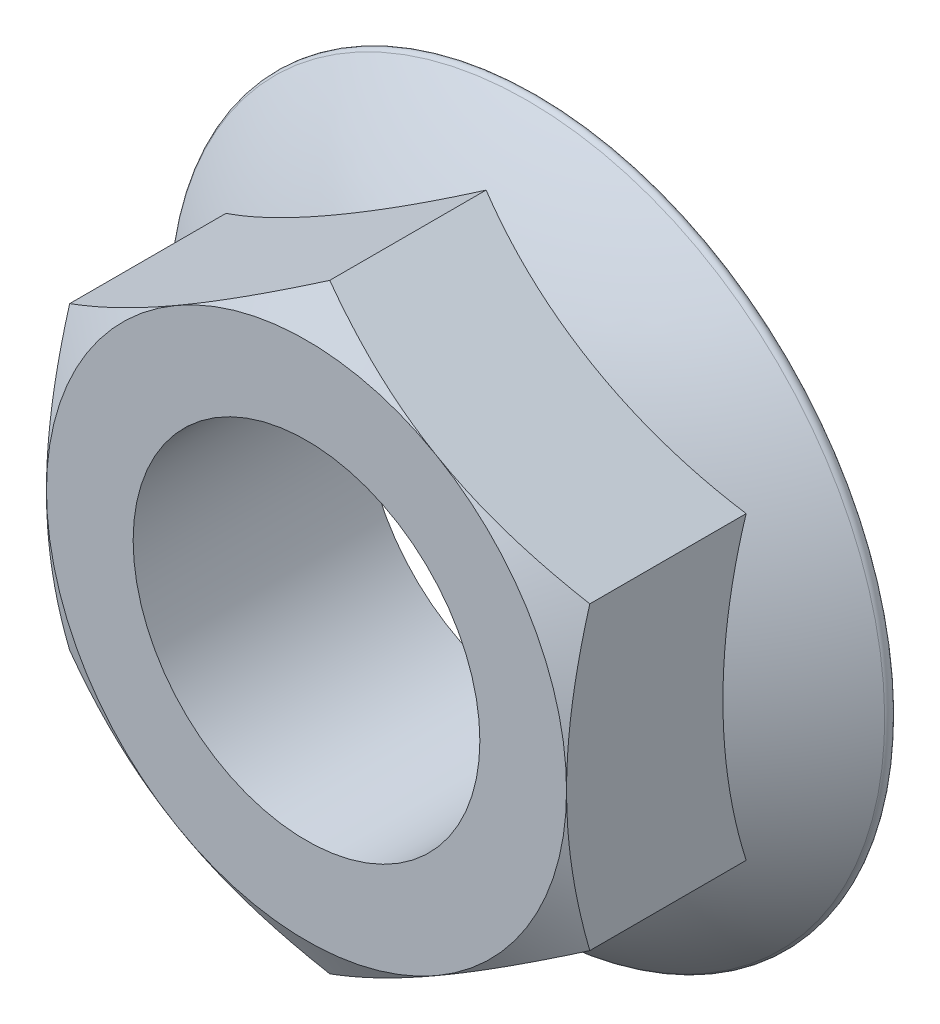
ISO-10303-21;
HEADER;
FILE_DESCRIPTION(('STEP AP214'),'2;1');
FILE_NAME('part.step','',(''),(''),'','','');
FILE_SCHEMA(('AUTOMOTIVE_DESIGN { 1 0 10303 214 1 1 1 1 }'));
ENDSEC;
DATA;
#1=APPLICATION_CONTEXT('core data for automotive mechanical design processes');
#2=APPLICATION_PROTOCOL_DEFINITION('international standard','automotive_design',2000,#1);
#3=PRODUCT_CONTEXT('',#1,'mechanical');
#4=PRODUCT('Part','Part','',(#3));
#5=PRODUCT_RELATED_PRODUCT_CATEGORY('part','',(#4));
#6=PRODUCT_DEFINITION_FORMATION('','',#4);
#7=PRODUCT_DEFINITION_CONTEXT('part definition',#1,'design');
#8=PRODUCT_DEFINITION('design','',#6,#7);
#9=PRODUCT_DEFINITION_SHAPE('','',#8);
#10=(LENGTH_UNIT() NAMED_UNIT(*) SI_UNIT(.MILLI.,.METRE.));
#11=(NAMED_UNIT(*) PLANE_ANGLE_UNIT() SI_UNIT($,.RADIAN.));
#12=(NAMED_UNIT(*) SI_UNIT($,.STERADIAN.) SOLID_ANGLE_UNIT());
#13=UNCERTAINTY_MEASURE_WITH_UNIT(LENGTH_MEASURE(1.E-05),#10,'distance_accuracy_value','');
#14=(GEOMETRIC_REPRESENTATION_CONTEXT(3) GLOBAL_UNCERTAINTY_ASSIGNED_CONTEXT((#13)) GLOBAL_UNIT_ASSIGNED_CONTEXT((#10,
#11,#12)) REPRESENTATION_CONTEXT('',''));
#15=CARTESIAN_POINT('',(0.,0.,0.));
#16=DIRECTION('',(0.,0.,1.));
#17=DIRECTION('',(1.,0.,0.));
#18=AXIS2_PLACEMENT_3D('',#15,#16,#17);
#19=CARTESIAN_POINT('',(22.4999999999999,12.9903810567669,20.));
#20=DIRECTION('',(-0.499999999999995,-0.866025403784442,0.));
#21=DIRECTION('',(0.866025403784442,-0.499999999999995,0.));
#22=AXIS2_PLACEMENT_3D('',#19,#20,#21);
#23=PLANE('',#22);
#24=CARTESIAN_POINT('',(22.5001999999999,12.990265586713,17.9903143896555));
#25=CARTESIAN_POINT('',(22.0056596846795,13.2757885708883,18.1551492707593));
#26=CARTESIAN_POINT('',(21.5091903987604,13.5624252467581,18.3125041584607));
#27=CARTESIAN_POINT('',(20.512270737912,14.1379970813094,18.6101747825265));
#28=CARTESIAN_POINT('',(20.0118191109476,14.4269329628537,18.7504849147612));
#29=CARTESIAN_POINT('',(19.0059568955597,15.0076677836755,19.0121827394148));
#30=CARTESIAN_POINT('',(18.5005374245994,15.2994718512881,19.1335252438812));
#31=CARTESIAN_POINT('',(17.4862080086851,15.8850952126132,19.3546738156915));
#32=CARTESIAN_POINT('',(16.9772984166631,16.1789143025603,19.4544820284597));
#33=CARTESIAN_POINT('',(15.9689969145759,16.7610574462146,19.6283253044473));
#34=CARTESIAN_POINT('',(15.4696797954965,17.0493383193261,19.7029352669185));
#35=CARTESIAN_POINT('',(14.4687576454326,17.6272209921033,19.8280391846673));
#36=CARTESIAN_POINT('',(13.9671525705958,17.9168228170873,19.8785326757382));
#37=CARTESIAN_POINT('',(12.9630998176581,18.4965129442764,19.9541287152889));
#38=CARTESIAN_POINT('',(12.4606538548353,18.7866002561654,19.9792614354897));
#39=CARTESIAN_POINT('',(11.4552982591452,19.3670425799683,20.0035954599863));
#40=CARTESIAN_POINT('',(10.9523886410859,19.6573975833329,20.002797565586));
#41=CARTESIAN_POINT('',(10.0121905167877,20.2002212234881,19.9770814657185));
#42=CARTESIAN_POINT('',(9.57483504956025,20.4527285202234,19.9552991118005));
#43=CARTESIAN_POINT('',(8.70116824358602,20.9571402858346,19.892536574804));
#44=CARTESIAN_POINT('',(8.26485688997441,21.2090447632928,19.8515566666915));
#45=CARTESIAN_POINT('',(7.39343951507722,21.7121578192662,19.7511092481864));
#46=CARTESIAN_POINT('',(6.95833494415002,21.9633655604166,19.6916250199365));
#47=CARTESIAN_POINT('',(6.09020916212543,22.464578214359,19.5552217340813));
#48=CARTESIAN_POINT('',(5.65718794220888,22.7145831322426,19.4783027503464));
#49=CARTESIAN_POINT('',(4.34262771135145,23.4735448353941,19.2194196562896));
#50=CARTESIAN_POINT('',(3.46482360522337,23.9803452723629,19.011627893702));
#51=CARTESIAN_POINT('',(2.15781149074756,24.7349490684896,18.6578721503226));
#52=CARTESIAN_POINT('',(1.72413098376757,24.9853346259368,18.5330695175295));
#53=CARTESIAN_POINT('',(0.859769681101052,25.4843738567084,18.2708295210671));
#54=CARTESIAN_POINT('',(0.429088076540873,25.7330279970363,18.1333957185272));
#55=CARTESIAN_POINT('',(-0.00019999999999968,25.980877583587,17.9903143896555));
#56=B_SPLINE_CURVE_WITH_KNOTS('',3,(#24,#25,#26,#27,#28,#29,#30,#31,#32,#33,#34,#35,#36,#37,#38,
#39,#40,#41,#42,#43,#44,#45,#46,#47,#48,#49,#50,#51,#52,#53,#54,#55),.UNSPECIFIED.,.F.,.F.,(4,2,
2,2,2,2,2,2,2,2,2,2,2,2,2,4),(0.,1.78312722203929,3.56683913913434,5.35473780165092,
7.14245825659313,8.88609109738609,10.6297574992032,12.3713470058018,14.1128826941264,
15.6289689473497,17.1450334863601,18.6624717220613,20.1799035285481,23.2816076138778,
24.8297579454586,26.3774731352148),.UNSPECIFIED.);
#57=CARTESIAN_POINT('',(22.4999999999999,12.9903810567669,17.9903810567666));
#58=VERTEX_POINT('',#57);
#59=CARTESIAN_POINT('',(11.2499999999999,19.4855715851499,20.));
#60=VERTEX_POINT('',#59);
#61=EDGE_CURVE('E111',#58,#60,#56,.T.);
#62=ORIENTED_EDGE('',*,*,#61,.F.);
#63=DIRECTION('',(0.,0.,-1.));
#64=VECTOR('',#63,1.);
#65=CARTESIAN_POINT('',(22.4999999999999,12.9903810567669,20.));
#66=LINE('',#65,#64);
#67=CARTESIAN_POINT('',(22.4999999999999,12.9903810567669,4.46039808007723));
#68=VERTEX_POINT('',#67);
#69=EDGE_CURVE('E243',#58,#68,#66,.T.);
#70=ORIENTED_EDGE('',*,*,#69,.T.);
#71=CARTESIAN_POINT('',(11.2499999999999,19.48557158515,-36.5334375));
#72=DIRECTION('',(-0.499999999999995,-0.866025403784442,0.));
#73=DIRECTION('',(0.866025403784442,-0.499999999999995,0.));
#74=AXIS2_PLACEMENT_3D('',#71,#72,#73);
#75=CIRCLE('',#74,43.0028435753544);
#76=CARTESIAN_POINT('',(0.,25.9807621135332,4.46039808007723));
#77=VERTEX_POINT('',#76);
#78=EDGE_CURVE('E244',#77,#68,#75,.F.);
#79=ORIENTED_EDGE('',*,*,#78,.F.);
#80=DIRECTION('',(0.,0.,-1.));
#81=VECTOR('',#80,1.);
#82=CARTESIAN_POINT('',(0.,25.9807621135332,20.));
#83=LINE('',#82,#81);
#84=CARTESIAN_POINT('',(0.,25.9807621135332,17.9903810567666));
#85=VERTEX_POINT('',#84);
#86=EDGE_CURVE('E59',#85,#77,#83,.T.);
#87=ORIENTED_EDGE('',*,*,#86,.F.);
#88=EDGE_CURVE('E121',#60,#85,#56,.T.);
#89=ORIENTED_EDGE('',*,*,#88,.F.);
#90=EDGE_LOOP('',(#62,#70,#79,#87,#89));
#91=FACE_BOUND('',#90,.T.);
#92=ADVANCED_FACE('F36',(#91),#23,.F.);
#93=CARTESIAN_POINT('',(0.,25.9807621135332,20.));
#94=DIRECTION('',(0.500000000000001,-0.866025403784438,0.));
#95=DIRECTION('',(0.866025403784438,0.500000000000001,0.));
#96=AXIS2_PLACEMENT_3D('',#93,#94,#95);
#97=PLANE('',#96);
#98=CARTESIAN_POINT('',(0.0002,25.980877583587,17.9903143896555));
#99=CARTESIAN_POINT('',(-0.494340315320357,25.6953545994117,18.1551492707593));
#100=CARTESIAN_POINT('',(-0.990809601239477,25.4087179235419,18.3125041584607));
#101=CARTESIAN_POINT('',(-1.98772926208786,24.8331460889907,18.6101747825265));
#102=CARTESIAN_POINT('',(-2.48818088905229,24.5442102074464,18.7504849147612));
#103=CARTESIAN_POINT('',(-3.49404310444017,23.9634753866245,19.0121827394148));
#104=CARTESIAN_POINT('',(-3.99946257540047,23.6716713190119,19.1335252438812));
#105=CARTESIAN_POINT('',(-5.01379199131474,23.0860479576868,19.3546738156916));
#106=CARTESIAN_POINT('',(-5.52270158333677,22.7922288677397,19.4544820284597));
#107=CARTESIAN_POINT('',(-6.53100308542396,22.2100857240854,19.6283253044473));
#108=CARTESIAN_POINT('',(-7.03032020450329,21.9218048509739,19.7029352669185));
#109=CARTESIAN_POINT('',(-8.03124235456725,21.3439221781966,19.8280391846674));
#110=CARTESIAN_POINT('',(-8.53284742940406,21.0543203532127,19.8785326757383));
#111=CARTESIAN_POINT('',(-9.53690018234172,20.4746302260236,19.954128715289));
#112=CARTESIAN_POINT('',(-10.0393461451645,20.1845429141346,19.9792614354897));
#113=CARTESIAN_POINT('',(-11.0447017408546,19.6041005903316,20.0035954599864));
#114=CARTESIAN_POINT('',(-11.5476113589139,19.313745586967,20.0027975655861));
#115=CARTESIAN_POINT('',(-12.4878094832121,18.7709219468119,19.9770814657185));
#116=CARTESIAN_POINT('',(-12.9251649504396,18.5184146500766,19.9552991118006));
#117=CARTESIAN_POINT('',(-13.7988317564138,18.0140028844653,19.892536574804));
#118=CARTESIAN_POINT('',(-14.2351431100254,17.7620984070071,19.8515566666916));
#119=CARTESIAN_POINT('',(-15.1065604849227,17.2589853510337,19.7511092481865));
#120=CARTESIAN_POINT('',(-15.5416650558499,17.0077776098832,19.6916250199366));
#121=CARTESIAN_POINT('',(-16.4097908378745,16.5065649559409,19.5552217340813));
#122=CARTESIAN_POINT('',(-16.842812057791,16.2565600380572,19.4783027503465));
#123=CARTESIAN_POINT('',(-18.1573722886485,15.4975983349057,19.2194196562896));
#124=CARTESIAN_POINT('',(-19.0351763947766,14.9907978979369,19.011627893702));
#125=CARTESIAN_POINT('',(-20.3421885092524,14.2361941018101,18.6578721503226));
#126=CARTESIAN_POINT('',(-20.7758690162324,13.9858085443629,18.5330695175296));
#127=CARTESIAN_POINT('',(-21.640230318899,13.4867693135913,18.2708295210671));
#128=CARTESIAN_POINT('',(-22.0709119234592,13.2381151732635,18.1333957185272));
#129=CARTESIAN_POINT('',(-22.5002,12.9902655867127,17.9903143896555));
#130=B_SPLINE_CURVE_WITH_KNOTS('',3,(#98,#99,#100,#101,#102,#103,#104,#105,#106,#107,#108,#109,
#110,#111,#112,#113,#114,#115,#116,#117,#118,#119,#120,#121,#122,#123,#124,#125,#126,#127,#128,
#129),.UNSPECIFIED.,.F.,.F.,(4,2,2,2,2,2,2,2,2,2,2,2,2,2,2,4),(0.,1.78312722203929,
3.56683913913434,5.35473780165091,7.14245825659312,8.88609109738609,10.6297574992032,
12.3713470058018,14.1128826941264,15.6289689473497,17.1450334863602,18.6624717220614,
20.1799035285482,23.281607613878,24.8297579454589,26.3774731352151),.UNSPECIFIED.);
#131=CARTESIAN_POINT('',(-11.25,19.4855715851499,20.));
#132=VERTEX_POINT('',#131);
#133=EDGE_CURVE('E125',#85,#132,#130,.T.);
#134=ORIENTED_EDGE('',*,*,#133,.F.);
#135=ORIENTED_EDGE('',*,*,#86,.T.);
#136=CARTESIAN_POINT('',(-11.25,19.4855715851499,-36.5334375));
#137=DIRECTION('',(0.500000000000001,-0.866025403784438,0.));
#138=DIRECTION('',(0.866025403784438,0.500000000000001,0.));
#139=AXIS2_PLACEMENT_3D('',#136,#137,#138);
#140=CIRCLE('',#139,43.0028435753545);
#141=CARTESIAN_POINT('',(-22.5,12.9903810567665,4.46039808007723));
#142=VERTEX_POINT('',#141);
#143=EDGE_CURVE('E246',#142,#77,#140,.F.);
#144=ORIENTED_EDGE('',*,*,#143,.F.);
#145=DIRECTION('',(0.,0.,-1.));
#146=VECTOR('',#145,1.);
#147=CARTESIAN_POINT('',(-22.5,12.9903810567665,20.));
#148=LINE('',#147,#146);
#149=CARTESIAN_POINT('',(-22.5,12.9903810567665,17.9903810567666));
#150=VERTEX_POINT('',#149);
#151=EDGE_CURVE('E194',#150,#142,#148,.T.);
#152=ORIENTED_EDGE('',*,*,#151,.F.);
#153=EDGE_CURVE('E132',#132,#150,#130,.T.);
#154=ORIENTED_EDGE('',*,*,#153,.F.);
#155=EDGE_LOOP('',(#134,#135,#144,#152,#154));
#156=FACE_BOUND('',#155,.T.);
#157=ADVANCED_FACE('F185',(#156),#97,.F.);
#158=CARTESIAN_POINT('',(-22.5,12.9903810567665,20.));
#159=DIRECTION('',(1.,0.,0.));
#160=DIRECTION('',(0.,1.,0.));
#161=AXIS2_PLACEMENT_3D('',#158,#159,#160);
#162=PLANE('',#161);
#163=CARTESIAN_POINT('',(-22.4999999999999,-35.2577842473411,8.84249398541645));
#164=CARTESIAN_POINT('',(-22.4999999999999,-34.7648189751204,9.08241190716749));
#165=CARTESIAN_POINT('',(-22.4999999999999,-34.2712850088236,9.32116038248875));
#166=CARTESIAN_POINT('',(-22.4999999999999,-33.282960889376,9.79605463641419));
#167=CARTESIAN_POINT('',(-22.4999999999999,-32.7881707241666,10.0322003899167));
#168=CARTESIAN_POINT('',(-22.4999999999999,-31.3016108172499,10.7363978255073));
#169=CARTESIAN_POINT('',(-22.4999999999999,-30.3077920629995,11.2001411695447));
#170=CARTESIAN_POINT('',(-22.4999999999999,-28.3083911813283,12.115815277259));
#171=CARTESIAN_POINT('',(-22.4999999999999,-27.302774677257,12.5676711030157));
#172=CARTESIAN_POINT('',(-22.4999999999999,-25.2836600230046,13.4533900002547));
#173=CARTESIAN_POINT('',(-22.4999999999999,-24.2701622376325,13.8872538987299));
#174=CARTESIAN_POINT('',(-22.4999999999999,-22.7259045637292,14.5279558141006));
#175=CARTESIAN_POINT('',(-22.4999999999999,-22.1986111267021,14.7431577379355));
#176=CARTESIAN_POINT('',(-22.4999999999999,-21.1412543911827,15.1666375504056));
#177=CARTESIAN_POINT('',(-22.4999999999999,-20.6111911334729,15.374915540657));
#178=CARTESIAN_POINT('',(-22.4999999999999,-19.5479627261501,15.7836427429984));
#179=CARTESIAN_POINT('',(-22.4999999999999,-19.014797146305,15.984090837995));
#180=CARTESIAN_POINT('',(-22.4999999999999,-17.9451948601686,16.376037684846));
#181=CARTESIAN_POINT('',(-22.4999999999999,-17.4087582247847,16.5675366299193));
#182=CARTESIAN_POINT('',(-22.4999999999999,-16.3333981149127,16.9399897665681));
#183=CARTESIAN_POINT('',(-22.5,-15.7944815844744,17.1209639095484));
#184=CARTESIAN_POINT('',(-22.5,-14.7129175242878,17.4713640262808));
#185=CARTESIAN_POINT('',(-22.5,-14.1702699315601,17.6407898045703));
#186=CARTESIAN_POINT('',(-22.5,-12.5366812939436,18.1293572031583));
#187=CARTESIAN_POINT('',(-22.5,-11.4396931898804,18.4289302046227));
#188=CARTESIAN_POINT('',(-22.5,-9.78532271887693,18.8275933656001));
#189=CARTESIAN_POINT('',(-22.5,-9.23392255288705,18.9517574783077));
#190=CARTESIAN_POINT('',(-22.5,-8.12728395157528,19.1817337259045));
#191=CARTESIAN_POINT('',(-22.5,-7.57204559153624,19.2875462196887));
#192=CARTESIAN_POINT('',(-22.5,-6.45810584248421,19.478972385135));
#193=CARTESIAN_POINT('',(-22.5,-5.89940460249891,19.5645869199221));
#194=CARTESIAN_POINT('',(-22.5,-4.77906430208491,19.7139299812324));
#195=CARTESIAN_POINT('',(-22.5,-4.21742524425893,19.7776585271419));
#196=CARTESIAN_POINT('',(-22.5,-3.09952249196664,19.8811376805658));
#197=CARTESIAN_POINT('',(-22.5,-2.54328766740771,19.9211982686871));
#198=CARTESIAN_POINT('',(-22.5,-1.42962208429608,19.977743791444));
#199=CARTESIAN_POINT('',(-22.5,-0.872191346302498,19.9942291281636));
#200=CARTESIAN_POINT('',(-22.5,0.242872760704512,20.0032303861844));
#201=CARTESIAN_POINT('',(-22.5,0.800506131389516,19.9957461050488));
#202=CARTESIAN_POINT('',(-22.5,1.9149527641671,19.9569944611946));
#203=CARTESIAN_POINT('',(-22.5,2.47176598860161,19.9257260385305));
#204=CARTESIAN_POINT('',(-22.5,3.79882687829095,19.8235334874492));
#205=CARTESIAN_POINT('',(-22.5,4.56826847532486,19.7419448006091));
#206=CARTESIAN_POINT('',(-22.5,6.10168534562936,19.5377067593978));
#207=CARTESIAN_POINT('',(-22.5,6.86565990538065,19.4150521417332));
#208=CARTESIAN_POINT('',(-22.5,8.38731905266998,19.1330447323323));
#209=CARTESIAN_POINT('',(-22.5,9.14499862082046,18.9736651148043));
#210=CARTESIAN_POINT('',(-22.5,10.6528807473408,18.6230872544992));
#211=CARTESIAN_POINT('',(-22.5,11.4030833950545,18.431889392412));
#212=CARTESIAN_POINT('',(-22.5,12.9132949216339,18.0176123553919));
#213=CARTESIAN_POINT('',(-22.5,13.6731280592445,17.7938969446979));
#214=CARTESIAN_POINT('',(-22.5000000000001,15.1853111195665,17.3225950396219));
#215=CARTESIAN_POINT('',(-22.5000000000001,15.9376609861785,17.0750083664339));
#216=CARTESIAN_POINT('',(-22.5000000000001,17.4352514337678,16.5599591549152));
#217=CARTESIAN_POINT('',(-22.5000000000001,18.1804940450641,16.2925024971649));
#218=CARTESIAN_POINT('',(-22.5000000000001,19.2936768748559,15.8788304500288));
#219=CARTESIAN_POINT('',(-22.5000000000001,19.663956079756,15.7388592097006));
#220=CARTESIAN_POINT('',(-22.5000000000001,20.4030507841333,15.4550996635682));
#221=CARTESIAN_POINT('',(-22.5000000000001,20.7718662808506,15.3113113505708));
#222=CARTESIAN_POINT('',(-22.5000000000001,21.7471587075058,14.9257471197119));
#223=CARTESIAN_POINT('',(-22.5000000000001,22.3524503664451,14.6809712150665));
#224=CARTESIAN_POINT('',(-22.5000000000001,23.5596556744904,14.1832111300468));
#225=CARTESIAN_POINT('',(-22.5000000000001,24.161569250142,13.9302267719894));
#226=CARTESIAN_POINT('',(-22.5000000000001,25.3623958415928,13.4171166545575));
#227=CARTESIAN_POINT('',(-22.5000000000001,25.9613086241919,13.1569903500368));
#228=CARTESIAN_POINT('',(-22.5000000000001,27.1564003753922,12.6305260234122));
#229=CARTESIAN_POINT('',(-22.5000000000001,27.7525793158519,12.3641879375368));
#230=CARTESIAN_POINT('',(-22.5000000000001,29.5378471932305,11.5568761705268));
#231=CARTESIAN_POINT('',(-22.5000000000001,30.7232648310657,11.0077781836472));
#232=CARTESIAN_POINT('',(-22.5000000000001,33.0861419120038,9.89290559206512));
#233=CARTESIAN_POINT('',(-22.5000000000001,34.2636016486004,9.32713160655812));
#234=CARTESIAN_POINT('',(-22.5000000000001,36.6138876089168,8.18158191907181));
#235=CARTESIAN_POINT('',(-22.5000000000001,37.786704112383,7.60178630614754));
#236=CARTESIAN_POINT('',(-22.5000000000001,40.1270902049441,6.43169694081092));
#237=CARTESIAN_POINT('',(-22.5000000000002,41.2946597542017,5.84140310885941));
#238=CARTESIAN_POINT('',(-22.5000000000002,43.6252353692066,4.65245788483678));
#239=CARTESIAN_POINT('',(-22.5000000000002,44.7882423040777,4.05380819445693));
#240=CARTESIAN_POINT('',(-22.5000000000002,47.1106566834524,2.84958195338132));
#241=CARTESIAN_POINT('',(-22.5000000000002,48.2700641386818,2.24400542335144));
#242=CARTESIAN_POINT('',(-22.5000000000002,50.4673829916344,1.08938102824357));
#243=CARTESIAN_POINT('',(-22.5000000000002,51.505586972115,0.540889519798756));
#244=CARTESIAN_POINT('',(-22.5000000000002,53.5799068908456,-0.560028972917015));
#245=CARTESIAN_POINT('',(-22.5000000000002,54.6160228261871,-1.11245596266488));
#246=CARTESIAN_POINT('',(-22.5000000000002,57.7217911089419,-2.77482802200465));
#247=CARTESIAN_POINT('',(-22.5000000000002,59.7887511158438,-3.88980473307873));
#248=CARTESIAN_POINT('',(-22.5000000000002,62.8817945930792,-5.56800626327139));
#249=CARTESIAN_POINT('',(-22.5000000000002,63.9099297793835,-6.12745909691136));
#250=CARTESIAN_POINT('',(-22.5000000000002,65.9650016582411,-7.24856345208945));
#251=CARTESIAN_POINT('',(-22.5000000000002,66.9919383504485,-7.81021497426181));
#252=CARTESIAN_POINT('',(-22.5000000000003,69.0446796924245,-8.93540211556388));
#253=CARTESIAN_POINT('',(-22.5000000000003,70.0704844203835,-9.49893759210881));
#254=CARTESIAN_POINT('',(-22.5000000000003,72.1211520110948,-10.627716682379));
#255=CARTESIAN_POINT('',(-22.5000000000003,73.1460148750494,-11.1929602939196));
#256=CARTESIAN_POINT('',(-22.5000000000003,74.1704651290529,-11.7589500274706));
#257=B_SPLINE_CURVE_WITH_KNOTS('',3,(#163,#164,#165,#166,#167,#168,#169,#170,#171,#172,#173,
#174,#175,#176,#177,#178,#179,#180,#181,#182,#183,#184,#185,#186,#187,#188,#189,#190,#191,#192,
#193,#194,#195,#196,#197,#198,#199,#200,#201,#202,#203,#204,#205,#206,#207,#208,#209,#210,#211,
#212,#213,#214,#215,#216,#217,#218,#219,#220,#221,#222,#223,#224,#225,#226,#227,#228,#229,#230,
#231,#232,#233,#234,#235,#236,#237,#238,#239,#240,#241,#242,#243,#244,#245,#246,#247,#248,#249,
#250,#251,#252,#253,#254,#255,#256),.UNSPECIFIED.,.F.,.F.,(4,2,2,2,2,2,2,2,2,2,2,2,2,2,2,2,2,2,
2,2,2,2,2,2,2,2,2,2,2,2,2,2,2,2,2,2,2,2,2,2,2,2,2,2,2,2,4),(0.,1.64473942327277,
3.28949469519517,6.5794738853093,9.88675305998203,13.1938800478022,14.9023931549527,
16.6108811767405,18.3196120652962,20.0283060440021,21.7336476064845,23.4390180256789,
26.8484838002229,28.5438591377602,30.239201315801,31.9344710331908,33.6297392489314,
35.3022817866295,36.9747957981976,38.6473239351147,40.3199266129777,42.6399175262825,
44.9602058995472,47.2821945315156,49.6041553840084,51.9799352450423,54.3557329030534,
56.7308302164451,57.9183688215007,59.1059096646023,61.0645686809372,63.0232701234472,
64.982121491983,66.9409929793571,70.8600498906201,74.7789614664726,78.7038092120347,
82.6286867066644,86.5527762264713,90.4768540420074,93.9993994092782,97.5219496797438,
104.567432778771,108.078904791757,111.590377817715,115.101590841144,118.612799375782),.UNSPECIFIED.);
#258=CARTESIAN_POINT('',(-22.5,0.,20.));
#259=VERTEX_POINT('',#258);
#260=EDGE_CURVE('E179',#150,#259,#257,.F.);
#261=ORIENTED_EDGE('',*,*,#260,.F.);
#262=ORIENTED_EDGE('',*,*,#151,.T.);
#263=CARTESIAN_POINT('',(-22.5,0.,-36.5334375));
#264=DIRECTION('',(1.,0.,0.));
#265=DIRECTION('',(0.,1.,0.));
#266=AXIS2_PLACEMENT_3D('',#263,#264,#265);
#267=CIRCLE('',#266,43.0028435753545);
#268=CARTESIAN_POINT('',(-22.5,-12.9903810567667,4.46039808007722));
#269=VERTEX_POINT('',#268);
#270=EDGE_CURVE('E212',#269,#142,#267,.F.);
#271=ORIENTED_EDGE('',*,*,#270,.F.);
#272=DIRECTION('',(0.,0.,-1.));
#273=VECTOR('',#272,1.);
#274=CARTESIAN_POINT('',(-22.5,-12.9903810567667,20.));
#275=LINE('',#274,#273);
#276=CARTESIAN_POINT('',(-22.5,-12.9903810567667,17.9903810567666));
#277=VERTEX_POINT('',#276);
#278=EDGE_CURVE('E210',#277,#269,#275,.T.);
#279=ORIENTED_EDGE('',*,*,#278,.F.);
#280=EDGE_CURVE('E174',#259,#277,#257,.F.);
#281=ORIENTED_EDGE('',*,*,#280,.F.);
#282=EDGE_LOOP('',(#261,#262,#271,#279,#281));
#283=FACE_BOUND('',#282,.T.);
#284=ADVANCED_FACE('F181',(#283),#162,.F.);
#285=CARTESIAN_POINT('',(-22.5,-12.9903810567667,20.));
#286=DIRECTION('',(0.499999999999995,0.866025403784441,0.));
#287=DIRECTION('',(-0.866025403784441,0.499999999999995,0.));
#288=AXIS2_PLACEMENT_3D('',#285,#286,#287);
#289=PLANE('',#288);
#290=CARTESIAN_POINT('',(-22.5002,-12.9902655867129,17.9903143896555));
#291=CARTESIAN_POINT('',(-22.0056596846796,-13.2757885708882,18.1551492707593));
#292=CARTESIAN_POINT('',(-21.5091903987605,-13.562425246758,18.3125041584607));
#293=CARTESIAN_POINT('',(-20.5122707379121,-14.1379970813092,18.6101747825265));
#294=CARTESIAN_POINT('',(-20.0118191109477,-14.4269329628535,18.7504849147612));
#295=CARTESIAN_POINT('',(-19.0059568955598,-15.0076677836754,19.0121827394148));
#296=CARTESIAN_POINT('',(-18.5005374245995,-15.299471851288,19.1335252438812));
#297=CARTESIAN_POINT('',(-17.4862080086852,-15.885095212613,19.3546738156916));
#298=CARTESIAN_POINT('',(-16.9772984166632,-16.1789143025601,19.4544820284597));
#299=CARTESIAN_POINT('',(-15.968996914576,-16.7610574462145,19.6283253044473));
#300=CARTESIAN_POINT('',(-15.4696797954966,-17.0493383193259,19.7029352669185));
#301=CARTESIAN_POINT('',(-14.4687576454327,-17.6272209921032,19.8280391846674));
#302=CARTESIAN_POINT('',(-13.9671525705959,-17.9168228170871,19.8785326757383));
#303=CARTESIAN_POINT('',(-12.9630998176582,-18.4965129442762,19.954128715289));
#304=CARTESIAN_POINT('',(-12.4606538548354,-18.7866002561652,19.9792614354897));
#305=CARTESIAN_POINT('',(-11.4552982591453,-19.3670425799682,20.0035954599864));
#306=CARTESIAN_POINT('',(-10.952388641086,-19.6573975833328,20.0027975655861));
#307=CARTESIAN_POINT('',(-10.0121905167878,-20.2002212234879,19.9770814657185));
#308=CARTESIAN_POINT('',(-9.57483504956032,-20.4527285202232,19.9552991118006));
#309=CARTESIAN_POINT('',(-8.70116824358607,-20.9571402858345,19.892536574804));
#310=CARTESIAN_POINT('',(-8.26485688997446,-21.2090447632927,19.8515566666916));
#311=CARTESIAN_POINT('',(-7.39343951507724,-21.7121578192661,19.7511092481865));
#312=CARTESIAN_POINT('',(-6.95833494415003,-21.9633655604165,19.6916250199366));
#313=CARTESIAN_POINT('',(-6.09020916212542,-22.4645782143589,19.5552217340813));
#314=CARTESIAN_POINT('',(-5.65718794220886,-22.7145831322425,19.4783027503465));
#315=CARTESIAN_POINT('',(-4.34262771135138,-23.4735448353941,19.2194196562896));
#316=CARTESIAN_POINT('',(-3.46482360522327,-23.9803452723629,19.011627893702));
#317=CARTESIAN_POINT('',(-2.15781149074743,-24.7349490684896,18.6578721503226));
#318=CARTESIAN_POINT('',(-1.72413098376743,-24.9853346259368,18.5330695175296));
#319=CARTESIAN_POINT('',(-0.859769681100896,-25.4843738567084,18.2708295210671));
#320=CARTESIAN_POINT('',(-0.429088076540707,-25.7330279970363,18.1333957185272));
#321=CARTESIAN_POINT('',(0.000200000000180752,-25.980877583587,17.9903143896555));
#322=B_SPLINE_CURVE_WITH_KNOTS('',3,(#290,#291,#292,#293,#294,#295,#296,#297,#298,#299,#300,
#301,#302,#303,#304,#305,#306,#307,#308,#309,#310,#311,#312,#313,#314,#315,#316,#317,#318,#319,
#320,#321),.UNSPECIFIED.,.F.,.F.,(4,2,2,2,2,2,2,2,2,2,2,2,2,2,2,4),(0.,1.7831272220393,
3.56683913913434,5.35473780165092,7.14245825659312,8.88609109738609,10.6297574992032,
12.3713470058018,14.1128826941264,15.6289689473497,17.1450334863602,18.6624717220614,
20.1799035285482,23.281607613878,24.8297579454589,26.3774731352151),.UNSPECIFIED.);
#323=CARTESIAN_POINT('',(-11.2499999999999,-19.4855715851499,20.));
#324=VERTEX_POINT('',#323);
#325=EDGE_CURVE('E180',#277,#324,#322,.T.);
#326=ORIENTED_EDGE('',*,*,#325,.F.);
#327=ORIENTED_EDGE('',*,*,#278,.T.);
#328=CARTESIAN_POINT('',(-11.2499999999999,-19.4855715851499,-36.5334375));
#329=DIRECTION('',(0.499999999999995,0.866025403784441,0.));
#330=DIRECTION('',(-0.866025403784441,0.499999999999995,0.));
#331=AXIS2_PLACEMENT_3D('',#328,#329,#330);
#332=CIRCLE('',#331,43.0028435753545);
#333=CARTESIAN_POINT('',(1.82145964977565E-13,-25.9807621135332,4.46039808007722));
#334=VERTEX_POINT('',#333);
#335=EDGE_CURVE('E252',#334,#269,#332,.F.);
#336=ORIENTED_EDGE('',*,*,#335,.F.);
#337=DIRECTION('',(0.,0.,-1.));
#338=VECTOR('',#337,1.);
#339=CARTESIAN_POINT('',(1.81422692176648E-13,-25.9807621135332,20.));
#340=LINE('',#339,#338);
#341=CARTESIAN_POINT('',(1.8150966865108E-13,-25.9807621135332,17.9903810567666));
#342=VERTEX_POINT('',#341);
#343=EDGE_CURVE('E216',#342,#334,#340,.T.);
#344=ORIENTED_EDGE('',*,*,#343,.F.);
#345=EDGE_CURVE('E169',#324,#342,#322,.T.);
#346=ORIENTED_EDGE('',*,*,#345,.F.);
#347=EDGE_LOOP('',(#326,#327,#336,#344,#346));
#348=FACE_BOUND('',#347,.T.);
#349=ADVANCED_FACE('F184',(#348),#289,.F.);
#350=CARTESIAN_POINT('',(1.81422692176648E-13,-25.9807621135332,20.));
#351=DIRECTION('',(-0.500000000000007,0.866025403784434,0.));
#352=DIRECTION('',(-0.866025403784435,-0.500000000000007,0.));
#353=AXIS2_PLACEMENT_3D('',#350,#351,#352);
#354=PLANE('',#353);
#355=CARTESIAN_POINT('',(-0.000199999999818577,-25.980877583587,17.9903143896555));
#356=CARTESIAN_POINT('',(0.494340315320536,-25.6953545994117,18.1551492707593));
#357=CARTESIAN_POINT('',(0.990809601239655,-25.4087179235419,18.3125041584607));
#358=CARTESIAN_POINT('',(1.98772926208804,-24.8331460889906,18.6101747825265));
#359=CARTESIAN_POINT('',(2.48818088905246,-24.5442102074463,18.7504849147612));
#360=CARTESIAN_POINT('',(3.49404310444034,-23.9634753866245,19.0121827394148));
#361=CARTESIAN_POINT('',(3.99946257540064,-23.6716713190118,19.1335252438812));
#362=CARTESIAN_POINT('',(5.0137919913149,-23.0860479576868,19.3546738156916));
#363=CARTESIAN_POINT('',(5.52270158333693,-22.7922288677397,19.4544820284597));
#364=CARTESIAN_POINT('',(6.53100308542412,-22.2100857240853,19.6283253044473));
#365=CARTESIAN_POINT('',(7.03032020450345,-21.9218048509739,19.7029352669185));
#366=CARTESIAN_POINT('',(8.0312423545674,-21.3439221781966,19.8280391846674));
#367=CARTESIAN_POINT('',(8.53284742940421,-21.0543203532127,19.8785326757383));
#368=CARTESIAN_POINT('',(9.53690018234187,-20.4746302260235,19.954128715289));
#369=CARTESIAN_POINT('',(10.0393461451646,-20.1845429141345,19.9792614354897));
#370=CARTESIAN_POINT('',(11.0447017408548,-19.6041005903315,20.0035954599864));
#371=CARTESIAN_POINT('',(11.547611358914,-19.313745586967,20.0027975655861));
#372=CARTESIAN_POINT('',(12.4878094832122,-18.7709219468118,19.9770814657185));
#373=CARTESIAN_POINT('',(12.9251649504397,-18.5184146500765,19.9552991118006));
#374=CARTESIAN_POINT('',(13.798831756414,-18.0140028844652,19.892536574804));
#375=CARTESIAN_POINT('',(14.2351431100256,-17.762098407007,19.8515566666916));
#376=CARTESIAN_POINT('',(15.1065604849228,-17.2589853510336,19.7511092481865));
#377=CARTESIAN_POINT('',(15.54166505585,-17.0077776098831,19.6916250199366));
#378=CARTESIAN_POINT('',(16.4097908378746,-16.5065649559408,19.5552217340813));
#379=CARTESIAN_POINT('',(16.8428120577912,-16.2565600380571,19.4783027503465));
#380=CARTESIAN_POINT('',(18.1573722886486,-15.4975983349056,19.2194196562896));
#381=CARTESIAN_POINT('',(19.0351763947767,-14.9907978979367,19.011627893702));
#382=CARTESIAN_POINT('',(20.3421885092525,-14.23619410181,18.6578721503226));
#383=CARTESIAN_POINT('',(20.7758690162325,-13.9858085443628,18.5330695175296));
#384=CARTESIAN_POINT('',(21.6402303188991,-13.4867693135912,18.2708295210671));
#385=CARTESIAN_POINT('',(22.0709119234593,-13.2381151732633,18.1333957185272));
#386=CARTESIAN_POINT('',(22.5002000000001,-12.9902655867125,17.9903143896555));
#387=B_SPLINE_CURVE_WITH_KNOTS('',3,(#355,#356,#357,#358,#359,#360,#361,#362,#363,#364,#365,
#366,#367,#368,#369,#370,#371,#372,#373,#374,#375,#376,#377,#378,#379,#380,#381,#382,#383,#384,
#385,#386),.UNSPECIFIED.,.F.,.F.,(4,2,2,2,2,2,2,2,2,2,2,2,2,2,2,4),(0.,1.78312722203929,
3.56683913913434,5.35473780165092,7.14245825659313,8.88609109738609,10.6297574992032,
12.3713470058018,14.1128826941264,15.6289689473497,17.1450334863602,18.6624717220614,
20.1799035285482,23.281607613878,24.8297579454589,26.3774731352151),.UNSPECIFIED.);
#388=CARTESIAN_POINT('',(11.2500000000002,-19.4855715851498,20.));
#389=VERTEX_POINT('',#388);
#390=EDGE_CURVE('E235',#342,#389,#387,.T.);
#391=ORIENTED_EDGE('',*,*,#390,.F.);
#392=ORIENTED_EDGE('',*,*,#343,.T.);
#393=CARTESIAN_POINT('',(11.2500000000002,-19.4855715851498,-36.5334375));
#394=DIRECTION('',(-0.500000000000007,0.866025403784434,0.));
#395=DIRECTION('',(-0.866025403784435,-0.500000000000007,0.));
#396=AXIS2_PLACEMENT_3D('',#393,#394,#395);
#397=CIRCLE('',#396,43.0028435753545);
#398=CARTESIAN_POINT('',(22.5000000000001,-12.9903810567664,4.46039808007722));
#399=VERTEX_POINT('',#398);
#400=EDGE_CURVE('E254',#399,#334,#397,.F.);
#401=ORIENTED_EDGE('',*,*,#400,.F.);
#402=DIRECTION('',(0.,0.,-1.));
#403=VECTOR('',#402,1.);
#404=CARTESIAN_POINT('',(22.5000000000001,-12.9903810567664,20.));
#405=LINE('',#404,#403);
#406=CARTESIAN_POINT('',(22.5000000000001,-12.9903810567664,17.9903810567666));
#407=VERTEX_POINT('',#406);
#408=EDGE_CURVE('E219',#407,#399,#405,.T.);
#409=ORIENTED_EDGE('',*,*,#408,.F.);
#410=EDGE_CURVE('E163',#389,#407,#387,.T.);
#411=ORIENTED_EDGE('',*,*,#410,.F.);
#412=EDGE_LOOP('',(#391,#392,#401,#409,#411));
#413=FACE_BOUND('',#412,.T.);
#414=ADVANCED_FACE('F234',(#413),#354,.F.);
#415=CARTESIAN_POINT('',(22.5000000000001,-12.9903810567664,20.));
#416=DIRECTION('',(-1.,0.,0.));
#417=DIRECTION('',(0.,-1.,0.));
#418=AXIS2_PLACEMENT_3D('',#415,#416,#417);
#419=PLANE('',#418);
#420=CARTESIAN_POINT('',(22.5000000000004,-35.2577842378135,8.8424939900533));
#421=CARTESIAN_POINT('',(22.5000000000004,-34.7648189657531,9.08241191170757));
#422=CARTESIAN_POINT('',(22.5000000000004,-34.2712849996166,9.3211603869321));
#423=CARTESIAN_POINT('',(22.5000000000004,-33.28296088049,9.79605464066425));
#424=CARTESIAN_POINT('',(22.5000000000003,-32.7881707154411,10.0322003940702));
#425=CARTESIAN_POINT('',(22.5000000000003,-31.3016108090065,10.7363978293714));
#426=CARTESIAN_POINT('',(22.5000000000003,-30.3077920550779,11.2001411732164));
#427=CARTESIAN_POINT('',(22.5000000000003,-28.3083911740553,12.1158152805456));
#428=CARTESIAN_POINT('',(22.5000000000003,-27.3027746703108,12.5676711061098));
#429=CARTESIAN_POINT('',(22.5000000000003,-25.2836600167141,13.4533900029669));
#430=CARTESIAN_POINT('',(22.5000000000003,-24.270162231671,13.8872539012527));
#431=CARTESIAN_POINT('',(22.5000000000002,-22.7259045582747,14.527955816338));
#432=CARTESIAN_POINT('',(22.5000000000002,-22.1986111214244,14.743157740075));
#433=CARTESIAN_POINT('',(22.5000000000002,-21.1412543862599,15.1666375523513));
#434=CARTESIAN_POINT('',(22.5000000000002,-20.611191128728,15.3749155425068));
#435=CARTESIAN_POINT('',(22.5000000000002,-19.5479627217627,15.783642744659));
#436=CARTESIAN_POINT('',(22.5000000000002,-19.0147971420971,15.9840908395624));
#437=CARTESIAN_POINT('',(22.5000000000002,-17.9451948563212,16.3760376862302));
#438=CARTESIAN_POINT('',(22.5000000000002,-17.4087582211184,16.5675366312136));
#439=CARTESIAN_POINT('',(22.5000000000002,-16.33339811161,16.9399897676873));
#440=CARTESIAN_POINT('',(22.5000000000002,-15.7944815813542,17.1209639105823));
#441=CARTESIAN_POINT('',(22.5000000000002,-14.7129175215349,17.4713640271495));
#442=CARTESIAN_POINT('',(22.5000000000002,-14.1702699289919,17.6407898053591));
#443=CARTESIAN_POINT('',(22.5000000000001,-12.5366812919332,18.1293572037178));
#444=CARTESIAN_POINT('',(22.5000000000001,-11.439693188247,18.4289302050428));
#445=CARTESIAN_POINT('',(22.5000000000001,-9.78532271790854,18.8275933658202));
#446=CARTESIAN_POINT('',(22.5000000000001,-9.23392255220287,18.9517574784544));
#447=CARTESIAN_POINT('',(22.5000000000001,-8.12728395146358,19.1817337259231));
#448=CARTESIAN_POINT('',(22.5000000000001,-7.57204559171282,19.2875462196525));
#449=CARTESIAN_POINT('',(22.5000000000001,-6.45810584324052,19.4789723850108));
#450=CARTESIAN_POINT('',(22.5000000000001,-5.89940460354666,19.5645869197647));
#451=CARTESIAN_POINT('',(22.5000000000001,-4.77906430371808,19.7139299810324));
#452=CARTESIAN_POINT('',(22.5,-4.21742524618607,19.7776585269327));
#453=CARTESIAN_POINT('',(22.5,-3.09952249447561,19.881137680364));
#454=CARTESIAN_POINT('',(22.5,-2.54328767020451,19.9211982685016));
#455=CARTESIAN_POINT('',(22.5,-1.42962208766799,19.9777437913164));
#456=CARTESIAN_POINT('',(22.5,-0.872191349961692,19.9942291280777));
#457=CARTESIAN_POINT('',(22.5,0.242872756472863,20.0032303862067));
#458=CARTESIAN_POINT('',(22.5,0.800506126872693,19.9957461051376));
#459=CARTESIAN_POINT('',(22.5,1.91495275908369,19.9569944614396));
#460=CARTESIAN_POINT('',(22.5,2.47176598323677,19.9257260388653));
#461=CARTESIAN_POINT('',(22.5,3.79882687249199,19.8235334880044));
#462=CARTESIAN_POINT('',(22.5,4.56826846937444,19.7419448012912));
#463=CARTESIAN_POINT('',(22.4999999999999,6.10168533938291,19.5377067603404));
#464=CARTESIAN_POINT('',(22.4999999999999,6.86565989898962,19.4150521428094));
#465=CARTESIAN_POINT('',(22.4999999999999,8.38731904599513,19.1330447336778));
#466=CARTESIAN_POINT('',(22.4999999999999,9.14499861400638,18.9736651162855));
#467=CARTESIAN_POINT('',(22.4999999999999,10.6528807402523,18.6230872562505));
#468=CARTESIAN_POINT('',(22.4999999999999,11.403083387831,18.4318893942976));
#469=CARTESIAN_POINT('',(22.4999999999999,12.9132949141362,18.017612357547));
#470=CARTESIAN_POINT('',(22.4999999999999,13.6731280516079,17.7938969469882));
#471=CARTESIAN_POINT('',(22.4999999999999,15.1853111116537,17.3225950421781));
#472=CARTESIAN_POINT('',(22.4999999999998,15.9376609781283,17.0750083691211));
#473=CARTESIAN_POINT('',(22.4999999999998,17.4352514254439,16.5599591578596));
#474=CARTESIAN_POINT('',(22.4999999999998,18.1804940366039,16.2925025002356));
#475=CARTESIAN_POINT('',(22.4999999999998,19.2936768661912,15.8788304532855));
#476=CARTESIAN_POINT('',(22.4999999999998,19.6639560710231,15.7388592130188));
#477=CARTESIAN_POINT('',(22.4999999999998,20.4030507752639,15.4550996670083));
#478=CARTESIAN_POINT('',(22.4999999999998,20.7718662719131,15.3113113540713));
#479=CARTESIAN_POINT('',(22.4999999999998,21.7471586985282,14.9257471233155));
#480=CARTESIAN_POINT('',(22.4999999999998,22.3524503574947,14.6809712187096));
#481=CARTESIAN_POINT('',(22.4999999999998,23.5596556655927,14.1832111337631));
#482=CARTESIAN_POINT('',(22.4999999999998,24.1615692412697,13.9302267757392));
#483=CARTESIAN_POINT('',(22.4999999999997,25.3623958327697,13.4171166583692));
#484=CARTESIAN_POINT('',(22.4999999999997,25.9613086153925,13.1569903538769));
#485=CARTESIAN_POINT('',(22.4999999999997,27.1564003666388,12.6305260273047));
#486=CARTESIAN_POINT('',(22.4999999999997,27.7525793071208,12.3641879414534));
#487=CARTESIAN_POINT('',(22.4999999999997,29.5378471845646,11.5568761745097));
#488=CARTESIAN_POINT('',(22.4999999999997,30.7232648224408,11.007778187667));
#489=CARTESIAN_POINT('',(22.4999999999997,33.0861419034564,9.89290559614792));
#490=CARTESIAN_POINT('',(22.4999999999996,34.2636016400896,9.32713161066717));
#491=CARTESIAN_POINT('',(22.4999999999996,36.6138876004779,8.18158192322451));
#492=CARTESIAN_POINT('',(22.4999999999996,37.7867041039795,7.60178631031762));
#493=CARTESIAN_POINT('',(22.4999999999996,40.1270901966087,6.43169694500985));
#494=CARTESIAN_POINT('',(22.4999999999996,41.2946597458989,5.84140311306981));
#495=CARTESIAN_POINT('',(22.4999999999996,43.6252353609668,4.65245788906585));
#496=CARTESIAN_POINT('',(22.4999999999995,44.7882422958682,4.05380819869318));
#497=CARTESIAN_POINT('',(22.4999999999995,47.1106566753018,2.84958195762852));
#498=CARTESIAN_POINT('',(22.4999999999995,48.2700641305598,2.24400542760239));
#499=CARTESIAN_POINT('',(22.4999999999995,50.4673829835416,1.0893810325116));
#500=CARTESIAN_POINT('',(22.4999999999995,51.5055869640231,0.540889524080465));
#501=CARTESIAN_POINT('',(22.4999999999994,53.5799068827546,-0.560028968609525));
#502=CARTESIAN_POINT('',(22.4999999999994,54.6160228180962,-1.11245595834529));
#503=CARTESIAN_POINT('',(22.4999999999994,57.7217911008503,-2.77482801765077));
#504=CARTESIAN_POINT('',(22.4999999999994,59.7887511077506,-3.8898047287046));
#505=CARTESIAN_POINT('',(22.4999999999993,62.8817945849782,-5.56800625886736));
#506=CARTESIAN_POINT('',(22.4999999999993,63.909929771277,-6.12745909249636));
#507=CARTESIAN_POINT('',(22.4999999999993,65.9650016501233,-7.24856344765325));
#508=CARTESIAN_POINT('',(22.4999999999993,66.9919383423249,-7.81021496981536));
#509=CARTESIAN_POINT('',(22.4999999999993,69.0446796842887,-8.93540211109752));
#510=CARTESIAN_POINT('',(22.4999999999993,70.0704844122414,-9.49893758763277));
#511=CARTESIAN_POINT('',(22.4999999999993,72.1211520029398,-10.6277166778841));
#512=CARTESIAN_POINT('',(22.4999999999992,73.1460148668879,-11.1929602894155));
#513=CARTESIAN_POINT('',(22.4999999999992,74.1704651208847,-11.7589500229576));
#514=B_SPLINE_CURVE_WITH_KNOTS('',3,(#420,#421,#422,#423,#424,#425,#426,#427,#428,#429,#430,
#431,#432,#433,#434,#435,#436,#437,#438,#439,#440,#441,#442,#443,#444,#445,#446,#447,#448,#449,
#450,#451,#452,#453,#454,#455,#456,#457,#458,#459,#460,#461,#462,#463,#464,#465,#466,#467,#468,
#469,#470,#471,#472,#473,#474,#475,#476,#477,#478,#479,#480,#481,#482,#483,#484,#485,#486,#487,
#488,#489,#490,#491,#492,#493,#494,#495,#496,#497,#498,#499,#500,#501,#502,#503,#504,#505,#506,
#507,#508,#509,#510,#511,#512,#513),.UNSPECIFIED.,.F.,.F.,(4,2,2,2,2,2,2,2,2,2,2,2,2,2,2,2,2,2,
2,2,2,2,2,2,2,2,2,2,2,2,2,2,2,2,2,2,2,2,2,2,2,2,2,2,2,2,4),(0.,1.6447394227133,3.28949469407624,
6.57947388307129,9.88675305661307,13.1938800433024,14.9023931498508,16.6108811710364,
18.3196120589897,20.0283060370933,21.7336475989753,23.4390180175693,26.8484837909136,
28.5438591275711,30.2392013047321,31.9344710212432,33.6297392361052,35.3022817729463,
36.9747957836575,38.6473239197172,40.3199265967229,42.639917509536,44.9602058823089,
47.2821945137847,49.6041553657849,51.9799352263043,54.355732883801,56.7308301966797,
57.9183688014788,59.1059096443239,61.0645686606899,63.0232701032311,64.9821214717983,
66.9409929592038,70.8600498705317,74.7789614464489,78.7038091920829,82.6286866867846,
86.5527762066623,90.4768540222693,93.9993993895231,97.5219496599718,104.567432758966,
108.078904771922,111.590377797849,115.101590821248,118.612799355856),.UNSPECIFIED.);
#515=CARTESIAN_POINT('',(22.5,2.34361077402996E-13,20.));
#516=VERTEX_POINT('',#515);
#517=EDGE_CURVE('E240',#407,#516,#514,.T.);
#518=ORIENTED_EDGE('',*,*,#517,.F.);
#519=ORIENTED_EDGE('',*,*,#408,.T.);
#520=CARTESIAN_POINT('',(22.5,2.41299971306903E-13,-36.5334375));
#521=DIRECTION('',(-1.,0.,0.));
#522=DIRECTION('',(0.,-1.,0.));
#523=AXIS2_PLACEMENT_3D('',#520,#521,#522);
#524=CIRCLE('',#523,43.0028435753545);
#525=EDGE_CURVE('E223',#68,#399,#524,.F.);
#526=ORIENTED_EDGE('',*,*,#525,.F.);
#527=ORIENTED_EDGE('',*,*,#69,.F.);
#528=EDGE_CURVE('E116',#516,#58,#514,.T.);
#529=ORIENTED_EDGE('',*,*,#528,.F.);
#530=EDGE_LOOP('',(#518,#519,#526,#527,#529));
#531=FACE_BOUND('',#530,.T.);
#532=ADVANCED_FACE('F242',(#531),#419,.F.);
#533=CARTESIAN_POINT('',(0.,0.,-36.5334375));
#534=DIRECTION('',(0.,0.,-1.));
#535=DIRECTION('',(0.,-1.,0.));
#536=AXIS2_PLACEMENT_3D('',#533,#534,#535);
#537=SPHERICAL_SURFACE('',#536,48.5334375);
#538=CARTESIAN_POINT('',(0.,0.,0.885496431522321));
#539=DIRECTION('',(0.,0.,-1.));
#540=DIRECTION('',(0.,1.,0.));
#541=AXIS2_PLACEMENT_3D('',#538,#539,#540);
#542=CIRCLE('',#541,30.9082179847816);
#543=CARTESIAN_POINT('',(0.,30.9082179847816,0.885496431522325));
#544=VERTEX_POINT('',#543);
#545=EDGE_CURVE('E255',#544,#544,#542,.T.);
#546=ORIENTED_EDGE('',*,*,#545,.F.);
#547=EDGE_LOOP('',(#546));
#548=FACE_BOUND('',#547,.T.);
#549=ORIENTED_EDGE('',*,*,#143,.T.);
#550=ORIENTED_EDGE('',*,*,#78,.T.);
#551=ORIENTED_EDGE('',*,*,#525,.T.);
#552=ORIENTED_EDGE('',*,*,#400,.T.);
#553=ORIENTED_EDGE('',*,*,#335,.T.);
#554=ORIENTED_EDGE('',*,*,#270,.T.);
#555=EDGE_LOOP('',(#549,#550,#551,#552,#553,#554));
#556=FACE_BOUND('',#555,.T.);
#557=ADVANCED_FACE('F265',(#548,#556),#537,.T.);
#558=CARTESIAN_POINT('',(0.,0.,0.500000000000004));
#559=DIRECTION('',(0.,0.,-1.));
#560=DIRECTION('',(0.,1.,0.));
#561=AXIS2_PLACEMENT_3D('',#558,#559,#560);
#562=TOROIDAL_SURFACE('',#561,30.589796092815,0.499999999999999);
#563=CARTESIAN_POINT('',(0.,0.,0.));
#564=DIRECTION('',(0.,0.,-1.));
#565=DIRECTION('',(0.,1.,0.));
#566=AXIS2_PLACEMENT_3D('',#563,#564,#565);
#567=CIRCLE('',#566,30.589796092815);
#568=CARTESIAN_POINT('',(0.,30.589796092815,0.));
#569=VERTEX_POINT('',#568);
#570=EDGE_CURVE('E120',#569,#569,#567,.T.);
#571=ORIENTED_EDGE('',*,*,#570,.F.);
#572=EDGE_LOOP('',(#571));
#573=FACE_BOUND('',#572,.T.);
#574=ORIENTED_EDGE('',*,*,#545,.T.);
#575=EDGE_LOOP('',(#574));
#576=FACE_BOUND('',#575,.T.);
#577=ADVANCED_FACE('F150',(#573,#576),#562,.T.);
#578=CARTESIAN_POINT('',(0.,0.,0.));
#579=DIRECTION('',(0.,0.,1.));
#580=DIRECTION('',(1.,0.,0.));
#581=AXIS2_PLACEMENT_3D('',#578,#579,#580);
#582=PLANE('',#581);
#583=CARTESIAN_POINT('',(0.,0.,0.));
#584=DIRECTION('',(0.,0.,1.));
#585=DIRECTION('',(1.,0.,0.));
#586=AXIS2_PLACEMENT_3D('',#583,#584,#585);
#587=CIRCLE('',#586,15.);
#588=CARTESIAN_POINT('',(15.,0.,0.));
#589=VERTEX_POINT('',#588);
#590=EDGE_CURVE('E130',#589,#589,#587,.T.);
#591=ORIENTED_EDGE('',*,*,#590,.T.);
#592=EDGE_LOOP('',(#591));
#593=FACE_BOUND('',#592,.T.);
#594=ORIENTED_EDGE('',*,*,#570,.T.);
#595=EDGE_LOOP('',(#594));
#596=FACE_BOUND('',#595,.T.);
#597=ADVANCED_FACE('F262',(#593,#596),#582,.F.);
#598=CARTESIAN_POINT('',(0.,0.,20.));
#599=DIRECTION('',(0.,0.,-1.));
#600=DIRECTION('',(1.,0.,0.));
#601=AXIS2_PLACEMENT_3D('',#598,#599,#600);
#602=CONICAL_SURFACE('',#601,22.5,1.0471975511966);
#603=ORIENTED_EDGE('',*,*,#410,.T.);
#604=ORIENTED_EDGE('',*,*,#517,.T.);
#605=CARTESIAN_POINT('',(0.,0.,20.));
#606=DIRECTION('',(0.,0.,1.));
#607=DIRECTION('',(1.,0.,0.));
#608=AXIS2_PLACEMENT_3D('',#605,#606,#607);
#609=CIRCLE('',#608,22.5);
#610=EDGE_CURVE('E40',#389,#516,#609,.T.);
#611=ORIENTED_EDGE('',*,*,#610,.F.);
#612=EDGE_LOOP('',(#603,#604,#611));
#613=FACE_BOUND('',#612,.T.);
#614=ADVANCED_FACE('F148',(#613),#602,.T.);
#615=ORIENTED_EDGE('',*,*,#345,.T.);
#616=ORIENTED_EDGE('',*,*,#390,.T.);
#617=EDGE_CURVE('E207',#324,#389,#609,.T.);
#618=ORIENTED_EDGE('',*,*,#617,.F.);
#619=EDGE_LOOP('',(#615,#616,#618));
#620=FACE_BOUND('',#619,.T.);
#621=ADVANCED_FACE('F287',(#620),#602,.T.);
#622=ORIENTED_EDGE('',*,*,#280,.T.);
#623=ORIENTED_EDGE('',*,*,#325,.T.);
#624=EDGE_CURVE('E202',#259,#324,#609,.T.);
#625=ORIENTED_EDGE('',*,*,#624,.F.);
#626=EDGE_LOOP('',(#622,#623,#625));
#627=FACE_BOUND('',#626,.T.);
#628=ADVANCED_FACE('F203',(#627),#602,.T.);
#629=ORIENTED_EDGE('',*,*,#153,.T.);
#630=ORIENTED_EDGE('',*,*,#260,.T.);
#631=EDGE_CURVE('E45',#132,#259,#609,.T.);
#632=ORIENTED_EDGE('',*,*,#631,.F.);
#633=EDGE_LOOP('',(#629,#630,#632));
#634=FACE_BOUND('',#633,.T.);
#635=ADVANCED_FACE('F198',(#634),#602,.T.);
#636=ORIENTED_EDGE('',*,*,#88,.T.);
#637=ORIENTED_EDGE('',*,*,#133,.T.);
#638=EDGE_CURVE('E12',#60,#132,#609,.T.);
#639=ORIENTED_EDGE('',*,*,#638,.F.);
#640=EDGE_LOOP('',(#636,#637,#639));
#641=FACE_BOUND('',#640,.T.);
#642=ADVANCED_FACE('F124',(#641),#602,.T.);
#643=ORIENTED_EDGE('',*,*,#61,.T.);
#644=CARTESIAN_POINT('',(0.,0.,20.));
#645=DIRECTION('',(0.,0.,1.));
#646=DIRECTION('',(1.,0.,0.));
#647=AXIS2_PLACEMENT_3D('',#644,#645,#646);
#648=CIRCLE('',#647,22.5);
#649=EDGE_CURVE('E114',#516,#60,#648,.T.);
#650=ORIENTED_EDGE('',*,*,#649,.F.);
#651=ORIENTED_EDGE('',*,*,#528,.T.);
#652=EDGE_LOOP('',(#643,#650,#651));
#653=FACE_BOUND('',#652,.T.);
#654=ADVANCED_FACE('F113',(#653),#602,.T.);
#655=CARTESIAN_POINT('',(0.,0.,20.));
#656=DIRECTION('',(0.,0.,1.));
#657=DIRECTION('',(1.,0.,0.));
#658=AXIS2_PLACEMENT_3D('',#655,#656,#657);
#659=PLANE('',#658);
#660=CARTESIAN_POINT('',(0.,0.,20.));
#661=DIRECTION('',(0.,0.,1.));
#662=DIRECTION('',(1.,0.,0.));
#663=AXIS2_PLACEMENT_3D('',#660,#661,#662);
#664=CIRCLE('',#663,15.);
#665=CARTESIAN_POINT('',(15.,0.,20.));
#666=VERTEX_POINT('',#665);
#667=EDGE_CURVE('E397',#666,#666,#664,.T.);
#668=ORIENTED_EDGE('',*,*,#667,.F.);
#669=EDGE_LOOP('',(#668));
#670=FACE_BOUND('',#669,.T.);
#671=ORIENTED_EDGE('',*,*,#610,.T.);
#672=ORIENTED_EDGE('',*,*,#649,.T.);
#673=ORIENTED_EDGE('',*,*,#638,.T.);
#674=ORIENTED_EDGE('',*,*,#631,.T.);
#675=ORIENTED_EDGE('',*,*,#624,.T.);
#676=ORIENTED_EDGE('',*,*,#617,.T.);
#677=EDGE_LOOP('',(#671,#672,#673,#674,#675,#676));
#678=FACE_BOUND('',#677,.T.);
#679=ADVANCED_FACE('F129',(#670,#678),#659,.T.);
#680=CARTESIAN_POINT('',(0.,0.,0.));
#681=DIRECTION('',(0.,0.,1.));
#682=DIRECTION('',(1.,0.,0.));
#683=AXIS2_PLACEMENT_3D('',#680,#681,#682);
#684=CYLINDRICAL_SURFACE('',#683,15.);
#685=ORIENTED_EDGE('',*,*,#590,.F.);
#686=EDGE_LOOP('',(#685));
#687=FACE_BOUND('',#686,.T.);
#688=ORIENTED_EDGE('',*,*,#667,.T.);
#689=EDGE_LOOP('',(#688));
#690=FACE_BOUND('',#689,.T.);
#691=ADVANCED_FACE('F149',(#687,#690),#684,.F.);
#692=CLOSED_SHELL('',(#92,#157,#284,#349,#414,#532,#557,#577,#597,#614,#621,#628,#635,#642,#654,
#679,#691));
#693=MANIFOLD_SOLID_BREP('B2',#692);
#694=ADVANCED_BREP_SHAPE_REPRESENTATION('',(#18,#693),#14);
#695=SHAPE_DEFINITION_REPRESENTATION(#9,#694);
ENDSEC;
END-ISO-10303-21;
